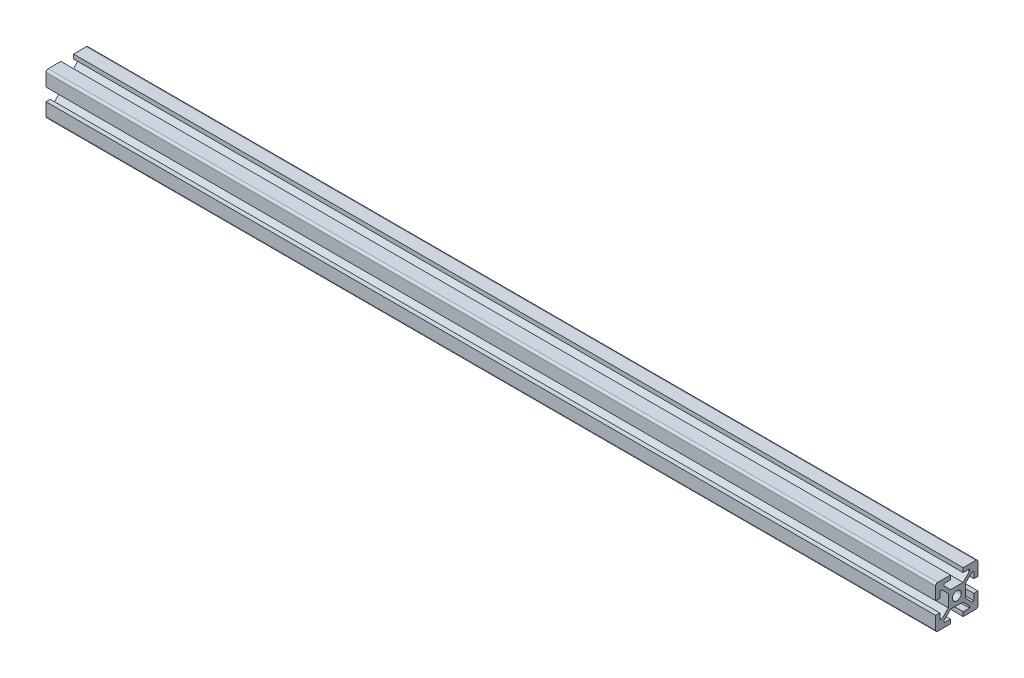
from build123d import *

# Parameters (mm, degrees)
SKETCH1_R           = 2.1
BOSS_EXTRUDE1_DEPTH = 420


with BuildPart() as part:
    # Sketch1 → Boss-Extrude1 (new body)
    with BuildSketch(Plane(origin=(0, 0, 0), x_dir=(0, 0, -1), z_dir=(1, 0, 0))):
        with BuildLine():
            Line((-10, 9), (-10, 3))
            Line((-10, 3), (-8, 3))
            Line((-8, 3), (-8, 6))
            Line((-8, 6), (-7.060660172, 6))
            Line((-7.060660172, 6), (-4, 2.939339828))
            Line((-4, 2.939339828), (-4, -2.939339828))
            Line((-4, -2.939339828), (-7.060660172, -6))
            Line((-7.060660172, -6), (-8, -6))
            Line((-8, -6), (-8, -3))
            Line((-8, -3), (-10, -3))
            Line((-10, -3), (-10, -9))
            ThreePointArc((-10, -9), (-9.707106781, -9.707106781), (-9, -10))
            Line((-9, -10), (-3, -10))
            Line((-3, -10), (-3, -8))
            Line((-3, -8), (-6, -8))
            Line((-6, -8), (-6, -7.060660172))
            Line((-6, -7.060660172), (-2.939339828, -4))
            Line((-2.939339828, -4), (2.939339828, -4))
            Line((2.939339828, -4), (6, -7.060660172))
            Line((6, -7.060660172), (6, -8))
            Line((6, -8), (3, -8))
            Line((3, -8), (3, -10))
            Line((3, -10), (9, -10))
            ThreePointArc((9, -10), (9.707106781, -9.707106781), (10, -9))
            Line((10, -9), (10, -3))
            Line((10, -3), (8, -3))
            Line((8, -3), (8, -6))
            Line((8, -6), (7.060660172, -6))
            Line((7.060660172, -6), (4, -2.939339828))
            Line((4, -2.939339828), (4, 2.939339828))
            Line((4, 2.939339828), (7.060660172, 6))
            Line((7.060660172, 6), (8, 6))
            Line((8, 6), (8, 3))
            Line((8, 3), (10, 3))
            Line((10, 3), (10, 9))
            ThreePointArc((10, 9), (9.707106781, 9.707106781), (9, 10))
            Line((9, 10), (3, 10))
            Line((3, 10), (3, 8))
            Line((3, 8), (6, 8))
            Line((6, 8), (6, 7.060660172))
            Line((6, 7.060660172), (2.939339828, 4))
            Line((2.939339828, 4), (-2.939339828, 4))
            Line((-2.939339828, 4), (-6, 7.060660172))
            Line((-6, 7.060660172), (-6, 8))
            Line((-6, 8), (-3, 8))
            Line((-3, 8), (-3, 10))
            Line((-3, 10), (-9, 10))
            ThreePointArc((-9, 10), (-9.707106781, 9.707106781), (-10, 9))
        make_face()
        Circle(SKETCH1_R, mode=Mode.SUBTRACT)
    extrude(amount=BOSS_EXTRUDE1_DEPTH)


solid = part.part
